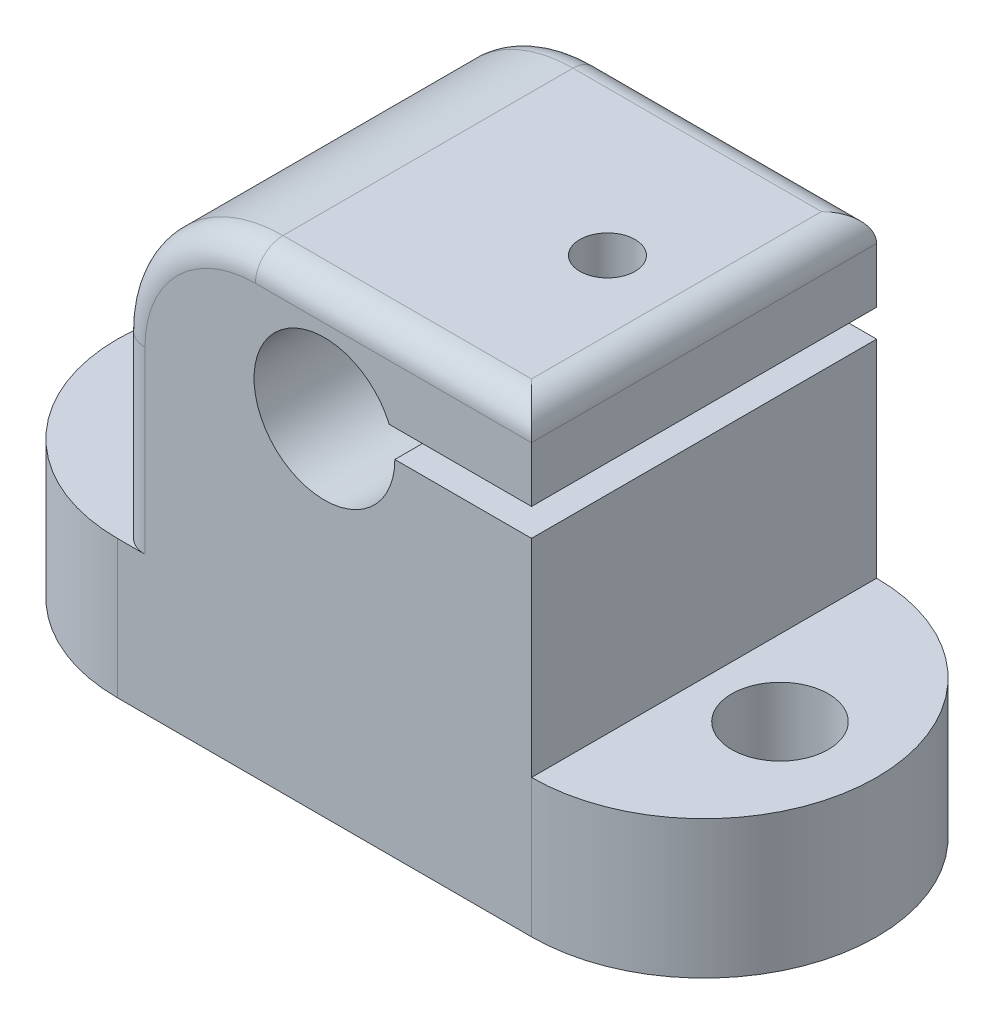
ISO-10303-21;
HEADER;
FILE_DESCRIPTION(('STEP AP214'),'2;1');
FILE_NAME('part.step','',(''),(''),'','','');
FILE_SCHEMA(('AUTOMOTIVE_DESIGN { 1 0 10303 214 1 1 1 1 }'));
ENDSEC;
DATA;
#1=APPLICATION_CONTEXT('core data for automotive mechanical design processes');
#2=APPLICATION_PROTOCOL_DEFINITION('international standard','automotive_design',2000,#1);
#3=PRODUCT_CONTEXT('',#1,'mechanical');
#4=PRODUCT('Part','Part','',(#3));
#5=PRODUCT_RELATED_PRODUCT_CATEGORY('part','',(#4));
#6=PRODUCT_DEFINITION_FORMATION('','',#4);
#7=PRODUCT_DEFINITION_CONTEXT('part definition',#1,'design');
#8=PRODUCT_DEFINITION('design','',#6,#7);
#9=PRODUCT_DEFINITION_SHAPE('','',#8);
#10=(LENGTH_UNIT() NAMED_UNIT(*) SI_UNIT(.MILLI.,.METRE.));
#11=(NAMED_UNIT(*) PLANE_ANGLE_UNIT() SI_UNIT($,.RADIAN.));
#12=(NAMED_UNIT(*) SI_UNIT($,.STERADIAN.) SOLID_ANGLE_UNIT());
#13=UNCERTAINTY_MEASURE_WITH_UNIT(LENGTH_MEASURE(1.E-05),#10,'distance_accuracy_value','');
#14=(GEOMETRIC_REPRESENTATION_CONTEXT(3) GLOBAL_UNCERTAINTY_ASSIGNED_CONTEXT((#13)) GLOBAL_UNIT_ASSIGNED_CONTEXT((#10,
#11,#12)) REPRESENTATION_CONTEXT('',''));
#15=CARTESIAN_POINT('',(0.,0.,0.));
#16=DIRECTION('',(0.,0.,1.));
#17=DIRECTION('',(1.,0.,0.));
#18=AXIS2_PLACEMENT_3D('',#15,#16,#17);
#19=CARTESIAN_POINT('',(-7.,15.,0.));
#20=DIRECTION('',(0.,1.,0.));
#21=DIRECTION('',(0.,0.,1.));
#22=AXIS2_PLACEMENT_3D('',#19,#20,#21);
#23=PLANE('',#22);
#24=CARTESIAN_POINT('',(-7.,15.,0.));
#25=DIRECTION('',(0.,1.,0.));
#26=DIRECTION('',(0.,0.,1.));
#27=AXIS2_PLACEMENT_3D('',#24,#25,#26);
#28=CIRCLE('',#27,1.5);
#29=CARTESIAN_POINT('',(-7.,15.,1.5));
#30=VERTEX_POINT('',#29);
#31=EDGE_CURVE('E239',#30,#30,#28,.T.);
#32=ORIENTED_EDGE('',*,*,#31,.T.);
#33=EDGE_LOOP('',(#32));
#34=FACE_BOUND('',#33,.T.);
#35=ADVANCED_FACE('F17',(#34),#23,.T.);
#36=CARTESIAN_POINT('',(-20.,23.,-43.54834939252));
#37=DIRECTION('',(0.,0.,1.));
#38=DIRECTION('',(1.,0.,0.));
#39=AXIS2_PLACEMENT_3D('',#36,#37,#38);
#40=CYLINDRICAL_SURFACE('',#39,10.);
#41=DIRECTION('',(0.,0.,1.));
#42=VECTOR('',#41,1.);
#43=CARTESIAN_POINT('',(-20.,33.,-43.54834939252));
#44=LINE('',#43,#42);
#45=CARTESIAN_POINT('',(-20.,33.,-10.5));
#46=VERTEX_POINT('',#45);
#47=CARTESIAN_POINT('',(-20.,33.,10.5));
#48=VERTEX_POINT('',#47);
#49=EDGE_CURVE('E125',#46,#48,#44,.T.);
#50=ORIENTED_EDGE('',*,*,#49,.F.);
#51=CARTESIAN_POINT('',(-20.,23.,-10.5));
#52=DIRECTION('',(0.,0.,1.));
#53=DIRECTION('',(1.,0.,0.));
#54=AXIS2_PLACEMENT_3D('',#51,#52,#53);
#55=CIRCLE('',#54,10.);
#56=CARTESIAN_POINT('',(-30.,23.,-10.5));
#57=VERTEX_POINT('',#56);
#58=EDGE_CURVE('E210',#57,#46,#55,.F.);
#59=ORIENTED_EDGE('',*,*,#58,.F.);
#60=DIRECTION('',(0.,0.,1.));
#61=VECTOR('',#60,1.);
#62=CARTESIAN_POINT('',(-30.,23.,-46.0410196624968));
#63=LINE('',#62,#61);
#64=CARTESIAN_POINT('',(-30.,23.,10.5));
#65=VERTEX_POINT('',#64);
#66=EDGE_CURVE('E115',#65,#57,#63,.F.);
#67=ORIENTED_EDGE('',*,*,#66,.F.);
#68=CARTESIAN_POINT('',(-20.,23.,10.5));
#69=DIRECTION('',(0.,0.,-1.));
#70=DIRECTION('',(-1.,0.,0.));
#71=AXIS2_PLACEMENT_3D('',#68,#69,#70);
#72=CIRCLE('',#71,10.);
#73=EDGE_CURVE('E147',#48,#65,#72,.F.);
#74=ORIENTED_EDGE('',*,*,#73,.F.);
#75=EDGE_LOOP('',(#50,#59,#67,#74));
#76=FACE_BOUND('',#75,.T.);
#77=ADVANCED_FACE('F148',(#76),#40,.T.);
#78=CARTESIAN_POINT('',(-30.,33.,-43.54834939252));
#79=DIRECTION('',(0.,1.,0.));
#80=DIRECTION('',(0.,0.,1.));
#81=AXIS2_PLACEMENT_3D('',#78,#79,#80);
#82=PLANE('',#81);
#83=ORIENTED_EDGE('',*,*,#49,.T.);
#84=DIRECTION('',(1.,0.,0.));
#85=VECTOR('',#84,1.);
#86=CARTESIAN_POINT('',(0.,33.,10.5));
#87=LINE('',#86,#85);
#88=CARTESIAN_POINT('',(-2.,33.,10.5));
#89=VERTEX_POINT('',#88);
#90=EDGE_CURVE('E129',#89,#48,#87,.F.);
#91=ORIENTED_EDGE('',*,*,#90,.F.);
#92=DIRECTION('',(0.,0.,1.));
#93=VECTOR('',#92,1.);
#94=CARTESIAN_POINT('',(-2.,33.,-43.54834939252));
#95=LINE('',#94,#93);
#96=CARTESIAN_POINT('',(-2.,33.,-10.5));
#97=VERTEX_POINT('',#96);
#98=EDGE_CURVE('E134',#97,#89,#95,.T.);
#99=ORIENTED_EDGE('',*,*,#98,.F.);
#100=DIRECTION('',(-1.,0.,0.));
#101=VECTOR('',#100,1.);
#102=CARTESIAN_POINT('',(0.,33.,-10.5));
#103=LINE('',#102,#101);
#104=EDGE_CURVE('E107',#46,#97,#103,.F.);
#105=ORIENTED_EDGE('',*,*,#104,.F.);
#106=EDGE_LOOP('',(#83,#91,#99,#105));
#107=FACE_BOUND('',#106,.T.);
#108=CARTESIAN_POINT('',(-7.,33.,0.));
#109=DIRECTION('',(0.,1.,0.));
#110=DIRECTION('',(0.,0.,1.));
#111=AXIS2_PLACEMENT_3D('',#108,#109,#110);
#112=CIRCLE('',#111,2.);
#113=CARTESIAN_POINT('',(-7.,33.,2.));
#114=VERTEX_POINT('',#113);
#115=EDGE_CURVE('E20',#114,#114,#112,.F.);
#116=ORIENTED_EDGE('',*,*,#115,.T.);
#117=EDGE_LOOP('',(#116));
#118=FACE_BOUND('',#117,.T.);
#119=ADVANCED_FACE('F127',(#107,#118),#82,.T.);
#120=CARTESIAN_POINT('',(-2.,31.,-43.54834939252));
#121=DIRECTION('',(0.,0.,1.));
#122=DIRECTION('',(1.,0.,0.));
#123=AXIS2_PLACEMENT_3D('',#120,#121,#122);
#124=CYLINDRICAL_SURFACE('',#123,2.);
#125=CARTESIAN_POINT('',(-2.,31.,10.5));
#126=DIRECTION('',(0.707106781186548,0.,-0.707106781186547));
#127=DIRECTION('',(0.707106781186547,0.,0.707106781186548));
#128=AXIS2_PLACEMENT_3D('',#125,#126,#127);
#129=ELLIPSE('',#128,2.82842712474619,2.);
#130=CARTESIAN_POINT('',(0.,31.,12.5));
#131=VERTEX_POINT('',#130);
#132=EDGE_CURVE('E145',#131,#89,#129,.F.);
#133=ORIENTED_EDGE('',*,*,#132,.F.);
#134=DIRECTION('',(0.,0.,-1.));
#135=VECTOR('',#134,1.);
#136=CARTESIAN_POINT('',(0.,31.,-43.54834939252));
#137=LINE('',#136,#135);
#138=CARTESIAN_POINT('',(0.,31.,-12.5));
#139=VERTEX_POINT('',#138);
#140=EDGE_CURVE('E159',#139,#131,#137,.F.);
#141=ORIENTED_EDGE('',*,*,#140,.F.);
#142=CARTESIAN_POINT('',(-2.,31.,-10.5));
#143=DIRECTION('',(-0.707106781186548,0.,-0.707106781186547));
#144=DIRECTION('',(-0.707106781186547,0.,0.707106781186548));
#145=AXIS2_PLACEMENT_3D('',#142,#143,#144);
#146=ELLIPSE('',#145,2.82842712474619,2.);
#147=EDGE_CURVE('E215',#97,#139,#146,.T.);
#148=ORIENTED_EDGE('',*,*,#147,.F.);
#149=ORIENTED_EDGE('',*,*,#98,.T.);
#150=EDGE_LOOP('',(#133,#141,#148,#149));
#151=FACE_BOUND('',#150,.T.);
#152=ADVANCED_FACE('F304',(#151),#124,.T.);
#153=CARTESIAN_POINT('',(-7.,25.,0.));
#154=DIRECTION('',(0.,1.,0.));
#155=DIRECTION('',(0.,0.,1.));
#156=AXIS2_PLACEMENT_3D('',#153,#154,#155);
#157=CYLINDRICAL_SURFACE('',#156,2.);
#158=CARTESIAN_POINT('',(-7.,27.,0.));
#159=DIRECTION('',(0.,1.,0.));
#160=DIRECTION('',(0.,0.,1.));
#161=AXIS2_PLACEMENT_3D('',#158,#159,#160);
#162=CIRCLE('',#161,2.);
#163=CARTESIAN_POINT('',(-7.,27.,2.));
#164=VERTEX_POINT('',#163);
#165=EDGE_CURVE('E161',#164,#164,#162,.T.);
#166=ORIENTED_EDGE('',*,*,#165,.F.);
#167=EDGE_LOOP('',(#166));
#168=FACE_BOUND('',#167,.T.);
#169=ORIENTED_EDGE('',*,*,#115,.F.);
#170=EDGE_LOOP('',(#169));
#171=FACE_BOUND('',#170,.T.);
#172=ADVANCED_FACE('F301',(#168,#171),#157,.F.);
#173=CARTESIAN_POINT('',(-7.,15.,0.));
#174=DIRECTION('',(0.,1.,0.));
#175=DIRECTION('',(0.,0.,1.));
#176=AXIS2_PLACEMENT_3D('',#173,#174,#175);
#177=CYLINDRICAL_SURFACE('',#176,1.5);
#178=CARTESIAN_POINT('',(-7.,25.,0.));
#179=DIRECTION('',(0.,1.,0.));
#180=DIRECTION('',(0.,0.,1.));
#181=AXIS2_PLACEMENT_3D('',#178,#179,#180);
#182=CIRCLE('',#181,1.5);
#183=CARTESIAN_POINT('',(-7.,25.,1.5));
#184=VERTEX_POINT('',#183);
#185=EDGE_CURVE('E286',#184,#184,#182,.F.);
#186=ORIENTED_EDGE('',*,*,#185,.F.);
#187=EDGE_LOOP('',(#186));
#188=FACE_BOUND('',#187,.T.);
#189=ORIENTED_EDGE('',*,*,#31,.F.);
#190=EDGE_LOOP('',(#189));
#191=FACE_BOUND('',#190,.T.);
#192=ADVANCED_FACE('F303',(#188,#191),#177,.F.);
#193=CARTESIAN_POINT('',(-30.,10.,-46.0410196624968));
#194=DIRECTION('',(-1.,0.,0.));
#195=DIRECTION('',(0.,0.,1.));
#196=AXIS2_PLACEMENT_3D('',#193,#194,#195);
#197=PLANE('',#196);
#198=ORIENTED_EDGE('',*,*,#66,.T.);
#199=DIRECTION('',(0.,-1.,0.));
#200=VECTOR('',#199,1.);
#201=CARTESIAN_POINT('',(-30.,10.,-10.5));
#202=LINE('',#201,#200);
#203=CARTESIAN_POINT('',(-30.,10.,-10.5));
#204=VERTEX_POINT('',#203);
#205=EDGE_CURVE('E219',#204,#57,#202,.F.);
#206=ORIENTED_EDGE('',*,*,#205,.F.);
#207=DIRECTION('',(0.,0.,1.));
#208=VECTOR('',#207,1.);
#209=CARTESIAN_POINT('',(-30.,10.,0.));
#210=LINE('',#209,#208);
#211=CARTESIAN_POINT('',(-30.,10.,10.5));
#212=VERTEX_POINT('',#211);
#213=EDGE_CURVE('E231',#212,#204,#210,.F.);
#214=ORIENTED_EDGE('',*,*,#213,.F.);
#215=DIRECTION('',(0.,1.,0.));
#216=VECTOR('',#215,1.);
#217=CARTESIAN_POINT('',(-30.,10.,10.5));
#218=LINE('',#217,#216);
#219=EDGE_CURVE('E229',#65,#212,#218,.F.);
#220=ORIENTED_EDGE('',*,*,#219,.F.);
#221=EDGE_LOOP('',(#198,#206,#214,#220));
#222=FACE_BOUND('',#221,.T.);
#223=ADVANCED_FACE('F312',(#222),#197,.T.);
#224=CARTESIAN_POINT('',(-28.,10.,-10.5));
#225=DIRECTION('',(0.,-1.,0.));
#226=DIRECTION('',(0.,0.,-1.));
#227=AXIS2_PLACEMENT_3D('',#224,#225,#226);
#228=CYLINDRICAL_SURFACE('',#227,2.);
#229=CARTESIAN_POINT('',(-28.,23.,-10.5));
#230=DIRECTION('',(0.,-1.,0.));
#231=DIRECTION('',(-1.,0.,0.));
#232=AXIS2_PLACEMENT_3D('',#229,#230,#231);
#233=CIRCLE('',#232,2.);
#234=CARTESIAN_POINT('',(-28.,23.,-12.5));
#235=VERTEX_POINT('',#234);
#236=EDGE_CURVE('E213',#235,#57,#233,.F.);
#237=ORIENTED_EDGE('',*,*,#236,.F.);
#238=DIRECTION('',(0.,1.,0.));
#239=VECTOR('',#238,1.);
#240=CARTESIAN_POINT('',(-28.,10.,-12.5));
#241=LINE('',#240,#239);
#242=CARTESIAN_POINT('',(-28.,10.,-12.5));
#243=VERTEX_POINT('',#242);
#244=EDGE_CURVE('E191',#235,#243,#241,.F.);
#245=ORIENTED_EDGE('',*,*,#244,.T.);
#246=CARTESIAN_POINT('',(-28.,10.,-10.5));
#247=DIRECTION('',(0.,-1.,0.));
#248=DIRECTION('',(0.,0.,-1.));
#249=AXIS2_PLACEMENT_3D('',#246,#247,#248);
#250=CIRCLE('',#249,2.);
#251=EDGE_CURVE('E284',#204,#243,#250,.T.);
#252=ORIENTED_EDGE('',*,*,#251,.F.);
#253=ORIENTED_EDGE('',*,*,#205,.T.);
#254=EDGE_LOOP('',(#237,#245,#252,#253));
#255=FACE_BOUND('',#254,.T.);
#256=ADVANCED_FACE('F512',(#255),#228,.T.);
#257=CARTESIAN_POINT('',(0.,31.,-10.5));
#258=DIRECTION('',(-1.,0.,0.));
#259=DIRECTION('',(0.,0.,1.));
#260=AXIS2_PLACEMENT_3D('',#257,#258,#259);
#261=CYLINDRICAL_SURFACE('',#260,2.);
#262=ORIENTED_EDGE('',*,*,#147,.T.);
#263=DIRECTION('',(1.,0.,0.));
#264=VECTOR('',#263,1.);
#265=CARTESIAN_POINT('',(0.,31.,-12.5));
#266=LINE('',#265,#264);
#267=CARTESIAN_POINT('',(-20.,31.,-12.5));
#268=VERTEX_POINT('',#267);
#269=EDGE_CURVE('E225',#139,#268,#266,.F.);
#270=ORIENTED_EDGE('',*,*,#269,.T.);
#271=CARTESIAN_POINT('',(-20.,31.,-10.5));
#272=DIRECTION('',(-1.,0.,0.));
#273=DIRECTION('',(0.,1.,0.));
#274=AXIS2_PLACEMENT_3D('',#271,#272,#273);
#275=CIRCLE('',#274,2.);
#276=EDGE_CURVE('E152',#46,#268,#275,.T.);
#277=ORIENTED_EDGE('',*,*,#276,.F.);
#278=ORIENTED_EDGE('',*,*,#104,.T.);
#279=EDGE_LOOP('',(#262,#270,#277,#278));
#280=FACE_BOUND('',#279,.T.);
#281=ADVANCED_FACE('F513',(#280),#261,.T.);
#282=CARTESIAN_POINT('',(-20.,23.,-10.5));
#283=DIRECTION('',(0.,0.,1.));
#284=DIRECTION('',(1.,0.,0.));
#285=AXIS2_PLACEMENT_3D('',#282,#283,#284);
#286=TOROIDAL_SURFACE('',#285,8.,2.);
#287=ORIENTED_EDGE('',*,*,#276,.T.);
#288=CARTESIAN_POINT('',(-20.,23.,-12.5));
#289=DIRECTION('',(0.,0.,1.));
#290=DIRECTION('',(0.,1.,0.));
#291=AXIS2_PLACEMENT_3D('',#288,#289,#290);
#292=CIRCLE('',#291,8.);
#293=EDGE_CURVE('E200',#268,#235,#292,.T.);
#294=ORIENTED_EDGE('',*,*,#293,.T.);
#295=ORIENTED_EDGE('',*,*,#236,.T.);
#296=ORIENTED_EDGE('',*,*,#58,.T.);
#297=EDGE_LOOP('',(#287,#294,#295,#296));
#298=FACE_BOUND('',#297,.T.);
#299=ADVANCED_FACE('F175',(#298),#286,.T.);
#300=CARTESIAN_POINT('',(-20.,23.,10.5));
#301=DIRECTION('',(0.,0.,-1.));
#302=DIRECTION('',(-1.,0.,0.));
#303=AXIS2_PLACEMENT_3D('',#300,#301,#302);
#304=TOROIDAL_SURFACE('',#303,8.,2.);
#305=CARTESIAN_POINT('',(-28.,23.,10.5));
#306=DIRECTION('',(0.,1.,0.));
#307=DIRECTION('',(0.,0.,1.));
#308=AXIS2_PLACEMENT_3D('',#305,#306,#307);
#309=CIRCLE('',#308,2.);
#310=CARTESIAN_POINT('',(-28.,23.,12.5));
#311=VERTEX_POINT('',#310);
#312=EDGE_CURVE('E232',#311,#65,#309,.F.);
#313=ORIENTED_EDGE('',*,*,#312,.F.);
#314=CARTESIAN_POINT('',(-20.,23.,12.5));
#315=DIRECTION('',(0.,0.,-1.));
#316=DIRECTION('',(-1.,0.,0.));
#317=AXIS2_PLACEMENT_3D('',#314,#315,#316);
#318=CIRCLE('',#317,8.);
#319=CARTESIAN_POINT('',(-20.,31.,12.5));
#320=VERTEX_POINT('',#319);
#321=EDGE_CURVE('E157',#311,#320,#318,.T.);
#322=ORIENTED_EDGE('',*,*,#321,.T.);
#323=CARTESIAN_POINT('',(-20.,31.,10.5));
#324=DIRECTION('',(1.,0.,0.));
#325=DIRECTION('',(0.,0.,-1.));
#326=AXIS2_PLACEMENT_3D('',#323,#324,#325);
#327=CIRCLE('',#326,2.);
#328=EDGE_CURVE('E142',#48,#320,#327,.T.);
#329=ORIENTED_EDGE('',*,*,#328,.F.);
#330=ORIENTED_EDGE('',*,*,#73,.T.);
#331=EDGE_LOOP('',(#313,#322,#329,#330));
#332=FACE_BOUND('',#331,.T.);
#333=ADVANCED_FACE('F155',(#332),#304,.T.);
#334=CARTESIAN_POINT('',(0.,31.,10.5));
#335=DIRECTION('',(1.,0.,0.));
#336=DIRECTION('',(0.,0.,-1.));
#337=AXIS2_PLACEMENT_3D('',#334,#335,#336);
#338=CYLINDRICAL_SURFACE('',#337,2.);
#339=ORIENTED_EDGE('',*,*,#328,.T.);
#340=DIRECTION('',(-1.,0.,0.));
#341=VECTOR('',#340,1.);
#342=CARTESIAN_POINT('',(0.,31.,12.5));
#343=LINE('',#342,#341);
#344=EDGE_CURVE('E372',#320,#131,#343,.F.);
#345=ORIENTED_EDGE('',*,*,#344,.T.);
#346=ORIENTED_EDGE('',*,*,#132,.T.);
#347=ORIENTED_EDGE('',*,*,#90,.T.);
#348=EDGE_LOOP('',(#339,#345,#346,#347));
#349=FACE_BOUND('',#348,.T.);
#350=ADVANCED_FACE('F139',(#349),#338,.T.);
#351=CARTESIAN_POINT('',(0.,27.,-43.54834939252));
#352=DIRECTION('',(1.,0.,0.));
#353=DIRECTION('',(0.,0.,-1.));
#354=AXIS2_PLACEMENT_3D('',#351,#352,#353);
#355=PLANE('',#354);
#356=DIRECTION('',(0.,1.,0.));
#357=VECTOR('',#356,1.);
#358=CARTESIAN_POINT('',(0.,10.,12.5));
#359=LINE('',#358,#357);
#360=CARTESIAN_POINT('',(0.,27.,12.5));
#361=VERTEX_POINT('',#360);
#362=EDGE_CURVE('E369',#131,#361,#359,.F.);
#363=ORIENTED_EDGE('',*,*,#362,.T.);
#364=DIRECTION('',(0.,0.,1.));
#365=VECTOR('',#364,1.);
#366=CARTESIAN_POINT('',(0.,27.,-43.54834939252));
#367=LINE('',#366,#365);
#368=CARTESIAN_POINT('',(0.,27.,-12.5));
#369=VERTEX_POINT('',#368);
#370=EDGE_CURVE('E293',#369,#361,#367,.T.);
#371=ORIENTED_EDGE('',*,*,#370,.F.);
#372=DIRECTION('',(0.,1.,0.));
#373=VECTOR('',#372,1.);
#374=CARTESIAN_POINT('',(0.,10.,-12.5));
#375=LINE('',#374,#373);
#376=EDGE_CURVE('E222',#369,#139,#375,.T.);
#377=ORIENTED_EDGE('',*,*,#376,.T.);
#378=ORIENTED_EDGE('',*,*,#140,.T.);
#379=EDGE_LOOP('',(#363,#371,#377,#378));
#380=FACE_BOUND('',#379,.T.);
#381=ADVANCED_FACE('F424',(#380),#355,.T.);
#382=CARTESIAN_POINT('',(0.,27.,-43.54834939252));
#383=DIRECTION('',(0.,-1.,0.));
#384=DIRECTION('',(1.,0.,0.));
#385=AXIS2_PLACEMENT_3D('',#382,#383,#384);
#386=PLANE('',#385);
#387=DIRECTION('',(-1.,0.,0.));
#388=VECTOR('',#387,1.);
#389=CARTESIAN_POINT('',(0.,27.,12.5));
#390=LINE('',#389,#388);
#391=CARTESIAN_POINT('',(-10.308518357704,27.,12.5));
#392=VERTEX_POINT('',#391);
#393=EDGE_CURVE('E272',#361,#392,#390,.T.);
#394=ORIENTED_EDGE('',*,*,#393,.T.);
#395=DIRECTION('',(0.,0.,1.));
#396=VECTOR('',#395,1.);
#397=CARTESIAN_POINT('',(-10.308518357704,27.,-12.5));
#398=LINE('',#397,#396);
#399=CARTESIAN_POINT('',(-10.308518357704,27.,-12.5));
#400=VERTEX_POINT('',#399);
#401=EDGE_CURVE('E290',#392,#400,#398,.F.);
#402=ORIENTED_EDGE('',*,*,#401,.T.);
#403=DIRECTION('',(1.,0.,0.));
#404=VECTOR('',#403,1.);
#405=CARTESIAN_POINT('',(0.,27.,-12.5));
#406=LINE('',#405,#404);
#407=EDGE_CURVE('E226',#400,#369,#406,.T.);
#408=ORIENTED_EDGE('',*,*,#407,.T.);
#409=ORIENTED_EDGE('',*,*,#370,.T.);
#410=EDGE_LOOP('',(#394,#402,#408,#409));
#411=FACE_BOUND('',#410,.T.);
#412=ORIENTED_EDGE('',*,*,#165,.T.);
#413=EDGE_LOOP('',(#412));
#414=FACE_BOUND('',#413,.T.);
#415=ADVANCED_FACE('F421',(#411,#414),#386,.T.);
#416=CARTESIAN_POINT('',(-15.,25.,-12.5));
#417=DIRECTION('',(0.,0.,1.));
#418=DIRECTION('',(1.,0.,0.));
#419=AXIS2_PLACEMENT_3D('',#416,#417,#418);
#420=CYLINDRICAL_SURFACE('',#419,5.1);
#421=ORIENTED_EDGE('',*,*,#401,.F.);
#422=CARTESIAN_POINT('',(-15.,25.,12.5));
#423=DIRECTION('',(0.,0.,1.));
#424=DIRECTION('',(1.,0.,0.));
#425=AXIS2_PLACEMENT_3D('',#422,#423,#424);
#426=CIRCLE('',#425,5.1);
#427=CARTESIAN_POINT('',(-9.9,25.,12.5));
#428=VERTEX_POINT('',#427);
#429=EDGE_CURVE('E268',#392,#428,#426,.T.);
#430=ORIENTED_EDGE('',*,*,#429,.T.);
#431=DIRECTION('',(0.,0.,1.));
#432=VECTOR('',#431,1.);
#433=CARTESIAN_POINT('',(-9.9,25.,-46.0410196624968));
#434=LINE('',#433,#432);
#435=CARTESIAN_POINT('',(-9.9,25.,-12.5));
#436=VERTEX_POINT('',#435);
#437=EDGE_CURVE('E289',#436,#428,#434,.T.);
#438=ORIENTED_EDGE('',*,*,#437,.F.);
#439=CARTESIAN_POINT('',(-15.,25.,-12.5));
#440=DIRECTION('',(0.,0.,1.));
#441=DIRECTION('',(1.,0.,0.));
#442=AXIS2_PLACEMENT_3D('',#439,#440,#441);
#443=CIRCLE('',#442,5.1);
#444=EDGE_CURVE('E276',#436,#400,#443,.F.);
#445=ORIENTED_EDGE('',*,*,#444,.T.);
#446=EDGE_LOOP('',(#421,#430,#438,#445));
#447=FACE_BOUND('',#446,.T.);
#448=ADVANCED_FACE('F417',(#447),#420,.F.);
#449=CARTESIAN_POINT('',(-30.,25.,-46.0410196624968));
#450=DIRECTION('',(0.,1.,0.));
#451=DIRECTION('',(0.,0.,1.));
#452=AXIS2_PLACEMENT_3D('',#449,#450,#451);
#453=PLANE('',#452);
#454=DIRECTION('',(0.,0.,1.));
#455=VECTOR('',#454,1.);
#456=CARTESIAN_POINT('',(0.,25.,-46.0410196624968));
#457=LINE('',#456,#455);
#458=CARTESIAN_POINT('',(0.,25.,-12.5));
#459=VERTEX_POINT('',#458);
#460=CARTESIAN_POINT('',(0.,25.,12.5));
#461=VERTEX_POINT('',#460);
#462=EDGE_CURVE('E448',#459,#461,#457,.T.);
#463=ORIENTED_EDGE('',*,*,#462,.F.);
#464=DIRECTION('',(1.,0.,0.));
#465=VECTOR('',#464,1.);
#466=CARTESIAN_POINT('',(0.,25.,-12.5));
#467=LINE('',#466,#465);
#468=EDGE_CURVE('E279',#459,#436,#467,.F.);
#469=ORIENTED_EDGE('',*,*,#468,.T.);
#470=ORIENTED_EDGE('',*,*,#437,.T.);
#471=DIRECTION('',(-1.,0.,0.));
#472=VECTOR('',#471,1.);
#473=CARTESIAN_POINT('',(0.,25.,12.5));
#474=LINE('',#473,#472);
#475=EDGE_CURVE('E271',#428,#461,#474,.F.);
#476=ORIENTED_EDGE('',*,*,#475,.T.);
#477=EDGE_LOOP('',(#463,#469,#470,#476));
#478=FACE_BOUND('',#477,.T.);
#479=ORIENTED_EDGE('',*,*,#185,.T.);
#480=EDGE_LOOP('',(#479));
#481=FACE_BOUND('',#480,.T.);
#482=ADVANCED_FACE('F413',(#478,#481),#453,.T.);
#483=CARTESIAN_POINT('',(0.,25.,-46.0410196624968));
#484=DIRECTION('',(1.,0.,0.));
#485=DIRECTION('',(0.,1.,0.));
#486=AXIS2_PLACEMENT_3D('',#483,#484,#485);
#487=PLANE('',#486);
#488=DIRECTION('',(0.,1.,0.));
#489=VECTOR('',#488,1.);
#490=CARTESIAN_POINT('',(0.,10.,12.5));
#491=LINE('',#490,#489);
#492=CARTESIAN_POINT('',(0.,10.,12.5));
#493=VERTEX_POINT('',#492);
#494=EDGE_CURVE('E364',#461,#493,#491,.F.);
#495=ORIENTED_EDGE('',*,*,#494,.T.);
#496=DIRECTION('',(0.,0.,1.));
#497=VECTOR('',#496,1.);
#498=CARTESIAN_POINT('',(0.,10.,0.));
#499=LINE('',#498,#497);
#500=CARTESIAN_POINT('',(0.,10.,-12.5));
#501=VERTEX_POINT('',#500);
#502=EDGE_CURVE('E283',#501,#493,#499,.T.);
#503=ORIENTED_EDGE('',*,*,#502,.F.);
#504=DIRECTION('',(0.,1.,0.));
#505=VECTOR('',#504,1.);
#506=CARTESIAN_POINT('',(0.,10.,-12.5));
#507=LINE('',#506,#505);
#508=EDGE_CURVE('E190',#501,#459,#507,.T.);
#509=ORIENTED_EDGE('',*,*,#508,.T.);
#510=ORIENTED_EDGE('',*,*,#462,.T.);
#511=EDGE_LOOP('',(#495,#503,#509,#510));
#512=FACE_BOUND('',#511,.T.);
#513=ADVANCED_FACE('F409',(#512),#487,.T.);
#514=CARTESIAN_POINT('',(-28.,10.,10.5));
#515=DIRECTION('',(0.,1.,0.));
#516=DIRECTION('',(0.,0.,1.));
#517=AXIS2_PLACEMENT_3D('',#514,#515,#516);
#518=CYLINDRICAL_SURFACE('',#517,2.);
#519=CARTESIAN_POINT('',(-28.,10.,10.5));
#520=DIRECTION('',(0.,1.,0.));
#521=DIRECTION('',(0.,0.,1.));
#522=AXIS2_PLACEMENT_3D('',#519,#520,#521);
#523=CIRCLE('',#522,2.);
#524=CARTESIAN_POINT('',(-28.,10.,12.5));
#525=VERTEX_POINT('',#524);
#526=EDGE_CURVE('E280',#525,#212,#523,.F.);
#527=ORIENTED_EDGE('',*,*,#526,.F.);
#528=DIRECTION('',(0.,1.,0.));
#529=VECTOR('',#528,1.);
#530=CARTESIAN_POINT('',(-28.,10.,12.5));
#531=LINE('',#530,#529);
#532=EDGE_CURVE('E351',#525,#311,#531,.T.);
#533=ORIENTED_EDGE('',*,*,#532,.T.);
#534=ORIENTED_EDGE('',*,*,#312,.T.);
#535=ORIENTED_EDGE('',*,*,#219,.T.);
#536=EDGE_LOOP('',(#527,#533,#534,#535));
#537=FACE_BOUND('',#536,.T.);
#538=ADVANCED_FACE('F405',(#537),#518,.T.);
#539=CARTESIAN_POINT('',(0.,10.,0.));
#540=DIRECTION('',(0.,1.,0.));
#541=DIRECTION('',(0.,0.,1.));
#542=AXIS2_PLACEMENT_3D('',#539,#540,#541);
#543=PLANE('',#542);
#544=CARTESIAN_POINT('',(-35.5,10.,0.));
#545=DIRECTION('',(0.,-1.,0.));
#546=DIRECTION('',(0.,0.,-1.));
#547=AXIS2_PLACEMENT_3D('',#544,#545,#546);
#548=CIRCLE('',#547,3.5);
#549=CARTESIAN_POINT('',(-35.5,10.,-3.49999999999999));
#550=VERTEX_POINT('',#549);
#551=EDGE_CURVE('E262',#550,#550,#548,.T.);
#552=ORIENTED_EDGE('',*,*,#551,.T.);
#553=EDGE_LOOP('',(#552));
#554=FACE_BOUND('',#553,.T.);
#555=DIRECTION('',(-1.,0.,0.));
#556=VECTOR('',#555,1.);
#557=CARTESIAN_POINT('',(0.,10.,12.5));
#558=LINE('',#557,#556);
#559=CARTESIAN_POINT('',(-30.,10.,12.5));
#560=VERTEX_POINT('',#559);
#561=EDGE_CURVE('E359',#560,#525,#558,.F.);
#562=ORIENTED_EDGE('',*,*,#561,.T.);
#563=ORIENTED_EDGE('',*,*,#526,.T.);
#564=ORIENTED_EDGE('',*,*,#213,.T.);
#565=ORIENTED_EDGE('',*,*,#251,.T.);
#566=DIRECTION('',(1.,0.,0.));
#567=VECTOR('',#566,1.);
#568=CARTESIAN_POINT('',(0.,10.,-12.5));
#569=LINE('',#568,#567);
#570=CARTESIAN_POINT('',(-30.,10.,-12.5));
#571=VERTEX_POINT('',#570);
#572=EDGE_CURVE('E183',#243,#571,#569,.F.);
#573=ORIENTED_EDGE('',*,*,#572,.T.);
#574=CARTESIAN_POINT('',(-30.,10.,0.));
#575=DIRECTION('',(0.,-1.,0.));
#576=DIRECTION('',(0.,0.,-1.));
#577=AXIS2_PLACEMENT_3D('',#574,#575,#576);
#578=CIRCLE('',#577,12.5);
#579=EDGE_CURVE('E273',#560,#571,#578,.T.);
#580=ORIENTED_EDGE('',*,*,#579,.F.);
#581=EDGE_LOOP('',(#562,#563,#564,#565,#573,#580));
#582=FACE_BOUND('',#581,.T.);
#583=ADVANCED_FACE('F401',(#554,#582),#543,.T.);
#584=CARTESIAN_POINT('',(0.,10.,0.));
#585=DIRECTION('',(0.,1.,0.));
#586=DIRECTION('',(0.,0.,1.));
#587=AXIS2_PLACEMENT_3D('',#584,#585,#586);
#588=PLANE('',#587);
#589=CARTESIAN_POINT('',(0.,10.,0.));
#590=DIRECTION('',(0.,-1.,0.));
#591=DIRECTION('',(0.,0.,-1.));
#592=AXIS2_PLACEMENT_3D('',#589,#590,#591);
#593=CIRCLE('',#592,12.5);
#594=EDGE_CURVE('E265',#501,#493,#593,.T.);
#595=ORIENTED_EDGE('',*,*,#594,.F.);
#596=ORIENTED_EDGE('',*,*,#502,.T.);
#597=EDGE_LOOP('',(#595,#596));
#598=FACE_BOUND('',#597,.T.);
#599=CARTESIAN_POINT('',(5.5,10.,0.));
#600=DIRECTION('',(0.,-1.,0.));
#601=DIRECTION('',(0.,0.,-1.));
#602=AXIS2_PLACEMENT_3D('',#599,#600,#601);
#603=CIRCLE('',#602,3.5);
#604=CARTESIAN_POINT('',(5.5,10.,-3.5));
#605=VERTEX_POINT('',#604);
#606=EDGE_CURVE('E259',#605,#605,#603,.T.);
#607=ORIENTED_EDGE('',*,*,#606,.T.);
#608=EDGE_LOOP('',(#607));
#609=FACE_BOUND('',#608,.T.);
#610=ADVANCED_FACE('F398',(#598,#609),#588,.T.);
#611=CARTESIAN_POINT('',(0.,10.,-12.5));
#612=DIRECTION('',(0.,0.,1.));
#613=DIRECTION('',(1.,0.,0.));
#614=AXIS2_PLACEMENT_3D('',#611,#612,#613);
#615=PLANE('',#614);
#616=ORIENTED_EDGE('',*,*,#269,.F.);
#617=ORIENTED_EDGE('',*,*,#376,.F.);
#618=ORIENTED_EDGE('',*,*,#407,.F.);
#619=ORIENTED_EDGE('',*,*,#444,.F.);
#620=ORIENTED_EDGE('',*,*,#468,.F.);
#621=ORIENTED_EDGE('',*,*,#508,.F.);
#622=DIRECTION('',(0.,-1.,0.));
#623=VECTOR('',#622,1.);
#624=CARTESIAN_POINT('',(0.,10.,-12.5));
#625=LINE('',#624,#623);
#626=CARTESIAN_POINT('',(0.,0.,-12.5));
#627=VERTEX_POINT('',#626);
#628=EDGE_CURVE('E267',#627,#501,#625,.F.);
#629=ORIENTED_EDGE('',*,*,#628,.F.);
#630=DIRECTION('',(1.,0.,0.));
#631=VECTOR('',#630,1.);
#632=CARTESIAN_POINT('',(0.,0.,-12.5));
#633=LINE('',#632,#631);
#634=CARTESIAN_POINT('',(-30.,0.,-12.5));
#635=VERTEX_POINT('',#634);
#636=EDGE_CURVE('E258',#627,#635,#633,.F.);
#637=ORIENTED_EDGE('',*,*,#636,.T.);
#638=DIRECTION('',(0.,-1.,0.));
#639=VECTOR('',#638,1.);
#640=CARTESIAN_POINT('',(-30.,10.,-12.5));
#641=LINE('',#640,#639);
#642=EDGE_CURVE('E275',#571,#635,#641,.T.);
#643=ORIENTED_EDGE('',*,*,#642,.F.);
#644=ORIENTED_EDGE('',*,*,#572,.F.);
#645=ORIENTED_EDGE('',*,*,#244,.F.);
#646=ORIENTED_EDGE('',*,*,#293,.F.);
#647=EDGE_LOOP('',(#616,#617,#618,#619,#620,#621,#629,#637,#643,#644,#645,#646));
#648=FACE_BOUND('',#647,.T.);
#649=ADVANCED_FACE('F389',(#648),#615,.F.);
#650=CARTESIAN_POINT('',(-30.,10.,0.));
#651=DIRECTION('',(0.,-1.,0.));
#652=DIRECTION('',(0.,0.,-1.));
#653=AXIS2_PLACEMENT_3D('',#650,#651,#652);
#654=CYLINDRICAL_SURFACE('',#653,12.5);
#655=ORIENTED_EDGE('',*,*,#579,.T.);
#656=ORIENTED_EDGE('',*,*,#642,.T.);
#657=CARTESIAN_POINT('',(-30.,0.,0.));
#658=DIRECTION('',(0.,-1.,0.));
#659=DIRECTION('',(0.,0.,-1.));
#660=AXIS2_PLACEMENT_3D('',#657,#658,#659);
#661=CIRCLE('',#660,12.5);
#662=CARTESIAN_POINT('',(-30.,0.,12.5));
#663=VERTEX_POINT('',#662);
#664=EDGE_CURVE('E255',#635,#663,#661,.F.);
#665=ORIENTED_EDGE('',*,*,#664,.T.);
#666=DIRECTION('',(0.,1.,0.));
#667=VECTOR('',#666,1.);
#668=CARTESIAN_POINT('',(-30.,10.,12.5));
#669=LINE('',#668,#667);
#670=EDGE_CURVE('E376',#663,#560,#669,.T.);
#671=ORIENTED_EDGE('',*,*,#670,.T.);
#672=EDGE_LOOP('',(#655,#656,#665,#671));
#673=FACE_BOUND('',#672,.T.);
#674=ADVANCED_FACE('F342',(#673),#654,.T.);
#675=CARTESIAN_POINT('',(0.,10.,12.5));
#676=DIRECTION('',(0.,0.,-1.));
#677=DIRECTION('',(-1.,0.,0.));
#678=AXIS2_PLACEMENT_3D('',#675,#676,#677);
#679=PLANE('',#678);
#680=ORIENTED_EDGE('',*,*,#561,.F.);
#681=ORIENTED_EDGE('',*,*,#670,.F.);
#682=DIRECTION('',(1.,0.,0.));
#683=VECTOR('',#682,1.);
#684=CARTESIAN_POINT('',(0.,0.,12.5));
#685=LINE('',#684,#683);
#686=CARTESIAN_POINT('',(0.,0.,12.5));
#687=VERTEX_POINT('',#686);
#688=EDGE_CURVE('E254',#663,#687,#685,.T.);
#689=ORIENTED_EDGE('',*,*,#688,.T.);
#690=DIRECTION('',(0.,-1.,0.));
#691=VECTOR('',#690,1.);
#692=CARTESIAN_POINT('',(0.,10.,12.5));
#693=LINE('',#692,#691);
#694=EDGE_CURVE('E35',#493,#687,#693,.T.);
#695=ORIENTED_EDGE('',*,*,#694,.F.);
#696=ORIENTED_EDGE('',*,*,#494,.F.);
#697=ORIENTED_EDGE('',*,*,#475,.F.);
#698=ORIENTED_EDGE('',*,*,#429,.F.);
#699=ORIENTED_EDGE('',*,*,#393,.F.);
#700=ORIENTED_EDGE('',*,*,#362,.F.);
#701=ORIENTED_EDGE('',*,*,#344,.F.);
#702=ORIENTED_EDGE('',*,*,#321,.F.);
#703=ORIENTED_EDGE('',*,*,#532,.F.);
#704=EDGE_LOOP('',(#680,#681,#689,#695,#696,#697,#698,#699,#700,#701,#702,#703));
#705=FACE_BOUND('',#704,.T.);
#706=ADVANCED_FACE('F338',(#705),#679,.F.);
#707=CARTESIAN_POINT('',(0.,10.,0.));
#708=DIRECTION('',(0.,-1.,0.));
#709=DIRECTION('',(0.,0.,-1.));
#710=AXIS2_PLACEMENT_3D('',#707,#708,#709);
#711=CYLINDRICAL_SURFACE('',#710,12.5);
#712=ORIENTED_EDGE('',*,*,#594,.T.);
#713=ORIENTED_EDGE('',*,*,#694,.T.);
#714=CARTESIAN_POINT('',(0.,0.,0.));
#715=DIRECTION('',(0.,-1.,0.));
#716=DIRECTION('',(0.,0.,-1.));
#717=AXIS2_PLACEMENT_3D('',#714,#715,#716);
#718=CIRCLE('',#717,12.5);
#719=EDGE_CURVE('E252',#687,#627,#718,.F.);
#720=ORIENTED_EDGE('',*,*,#719,.T.);
#721=ORIENTED_EDGE('',*,*,#628,.T.);
#722=EDGE_LOOP('',(#712,#713,#720,#721));
#723=FACE_BOUND('',#722,.T.);
#724=ADVANCED_FACE('F334',(#723),#711,.T.);
#725=CARTESIAN_POINT('',(-35.5,10.,0.));
#726=DIRECTION('',(0.,-1.,0.));
#727=DIRECTION('',(0.,0.,-1.));
#728=AXIS2_PLACEMENT_3D('',#725,#726,#727);
#729=CYLINDRICAL_SURFACE('',#728,3.5);
#730=CARTESIAN_POINT('',(-35.5,0.,0.));
#731=DIRECTION('',(0.,-1.,0.));
#732=DIRECTION('',(0.,0.,-1.));
#733=AXIS2_PLACEMENT_3D('',#730,#731,#732);
#734=CIRCLE('',#733,3.5);
#735=CARTESIAN_POINT('',(-35.5,0.,-3.49999999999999));
#736=VERTEX_POINT('',#735);
#737=EDGE_CURVE('E26',#736,#736,#734,.T.);
#738=ORIENTED_EDGE('',*,*,#737,.T.);
#739=EDGE_LOOP('',(#738));
#740=FACE_BOUND('',#739,.T.);
#741=ORIENTED_EDGE('',*,*,#551,.F.);
#742=EDGE_LOOP('',(#741));
#743=FACE_BOUND('',#742,.T.);
#744=ADVANCED_FACE('F326',(#740,#743),#729,.F.);
#745=CARTESIAN_POINT('',(5.5,10.,0.));
#746=DIRECTION('',(0.,-1.,0.));
#747=DIRECTION('',(0.,0.,-1.));
#748=AXIS2_PLACEMENT_3D('',#745,#746,#747);
#749=CYLINDRICAL_SURFACE('',#748,3.5);
#750=CARTESIAN_POINT('',(5.5,0.,0.));
#751=DIRECTION('',(0.,-1.,0.));
#752=DIRECTION('',(0.,0.,-1.));
#753=AXIS2_PLACEMENT_3D('',#750,#751,#752);
#754=CIRCLE('',#753,3.5);
#755=CARTESIAN_POINT('',(5.5,0.,-3.5));
#756=VERTEX_POINT('',#755);
#757=EDGE_CURVE('E11',#756,#756,#754,.T.);
#758=ORIENTED_EDGE('',*,*,#757,.T.);
#759=EDGE_LOOP('',(#758));
#760=FACE_BOUND('',#759,.T.);
#761=ORIENTED_EDGE('',*,*,#606,.F.);
#762=EDGE_LOOP('',(#761));
#763=FACE_BOUND('',#762,.T.);
#764=ADVANCED_FACE('F320',(#760,#763),#749,.F.);
#765=CARTESIAN_POINT('',(0.,0.,0.));
#766=DIRECTION('',(0.,1.,0.));
#767=DIRECTION('',(0.,0.,1.));
#768=AXIS2_PLACEMENT_3D('',#765,#766,#767);
#769=PLANE('',#768);
#770=ORIENTED_EDGE('',*,*,#757,.F.);
#771=EDGE_LOOP('',(#770));
#772=FACE_BOUND('',#771,.T.);
#773=ORIENTED_EDGE('',*,*,#737,.F.);
#774=EDGE_LOOP('',(#773));
#775=FACE_BOUND('',#774,.T.);
#776=ORIENTED_EDGE('',*,*,#688,.F.);
#777=ORIENTED_EDGE('',*,*,#664,.F.);
#778=ORIENTED_EDGE('',*,*,#636,.F.);
#779=ORIENTED_EDGE('',*,*,#719,.F.);
#780=EDGE_LOOP('',(#776,#777,#778,#779));
#781=FACE_BOUND('',#780,.T.);
#782=ADVANCED_FACE('F318',(#772,#775,#781),#769,.F.);
#783=CLOSED_SHELL('',(#35,#77,#119,#152,#172,#192,#223,#256,#281,#299,#333,#350,#381,#415,#448,
#482,#513,#538,#583,#610,#649,#674,#706,#724,#744,#764,#782));
#784=MANIFOLD_SOLID_BREP('B1',#783);
#785=ADVANCED_BREP_SHAPE_REPRESENTATION('',(#18,#784),#14);
#786=SHAPE_DEFINITION_REPRESENTATION(#9,#785);
ENDSEC;
END-ISO-10303-21;
